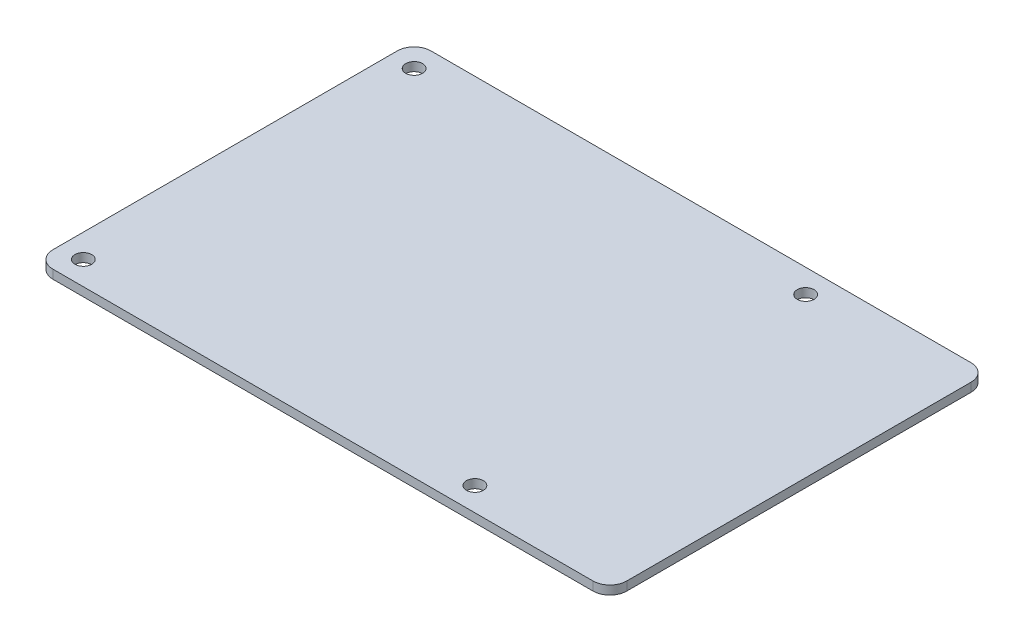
from build123d import *

# Parameters (mm, degrees)
SCHIZZO1_R                   = 1.25
ESTRUSIONE_ESTRUSIONE1_DEPTH = 1.3


with BuildPart() as part:
    # Schizzo1 → Estrusione-Estrusione1 (new body)
    with BuildSketch(Plane(origin=(0, 0, 0), x_dir=(1, 0, 0), z_dir=(0, 1, 0))):
        with BuildLine():
            Line((42.5, -25.5), (42.5, 25.5))
            ThreePointArc((42.5, 25.5), (41.767766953, 27.267766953), (40, 28))
            Line((40, 28), (-40, 28))
            ThreePointArc((-40, 28), (-41.767766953, 27.267766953), (-42.5, 25.5))
            Line((-42.5, 25.5), (-42.5, -25.5))
            ThreePointArc((-42.5, -25.5), (-41.767766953, -27.267766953), (-40, -28))
            Line((-40, -28), (40, -28))
            ThreePointArc((40, -28), (41.767766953, -27.267766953), (42.5, -25.5))
        make_face()
        with Locations(Location((19, 24.5, 0), (0, 0, 90))):
            Circle(SCHIZZO1_R, mode=Mode.SUBTRACT)
        with Locations(Location((-39, 24.5, 0), (0, 0, 90))):
            Circle(SCHIZZO1_R, mode=Mode.SUBTRACT)
        with Locations(Location((-39, -24.5, 0), (0, 0, 90))):
            Circle(SCHIZZO1_R, mode=Mode.SUBTRACT)
        with Locations(Location((19, -24.5, 0), (0, 0, 90))):
            Circle(SCHIZZO1_R, mode=Mode.SUBTRACT)
    extrude(amount=-ESTRUSIONE_ESTRUSIONE1_DEPTH)


solid = part.part
